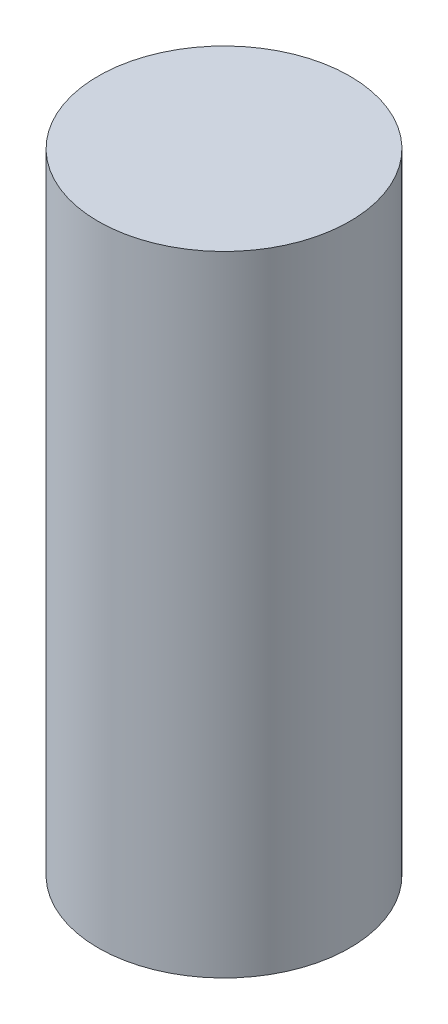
from build123d import *

# Parameters (mm, degrees)
ESQUISSE1_R         = 5
EXTRUSION1_DEPTH    = 20
ESQUISSE3_OUTSIDE_W = 16.898
ESQUISSE3_OUTSIDE_H = 16.898
ESQUISSE3_OUTSIDE_R = 4
EXTRUSION2_DEPTH    = 24


with BuildPart() as part:
    # Esquisse1 → Extrusion1 (new body)
    with BuildSketch(Plane(origin=(0, 0, 0), x_dir=(1, 0, 0), z_dir=(0, 1, 0))):
        with Locations(Location((0, 0, 0), (0, 0, 270))):
            Circle(ESQUISSE1_R)
    extrude(amount=EXTRUSION1_DEPTH)

    # Esquisse3 outside → Extrusion2 (cut)
    with BuildSketch(Plane(origin=(0, 20, 0), x_dir=(-1, 0, 0), z_dir=(0, 1, 0))):
        Rectangle(ESQUISSE3_OUTSIDE_W, ESQUISSE3_OUTSIDE_H)
        with Locations(Location((0, 0, 0), (0, 0, 90))):
            Circle(ESQUISSE3_OUTSIDE_R, mode=Mode.SUBTRACT)
    extrude(amount=-EXTRUSION2_DEPTH, mode=Mode.SUBTRACT)


solid = part.part
